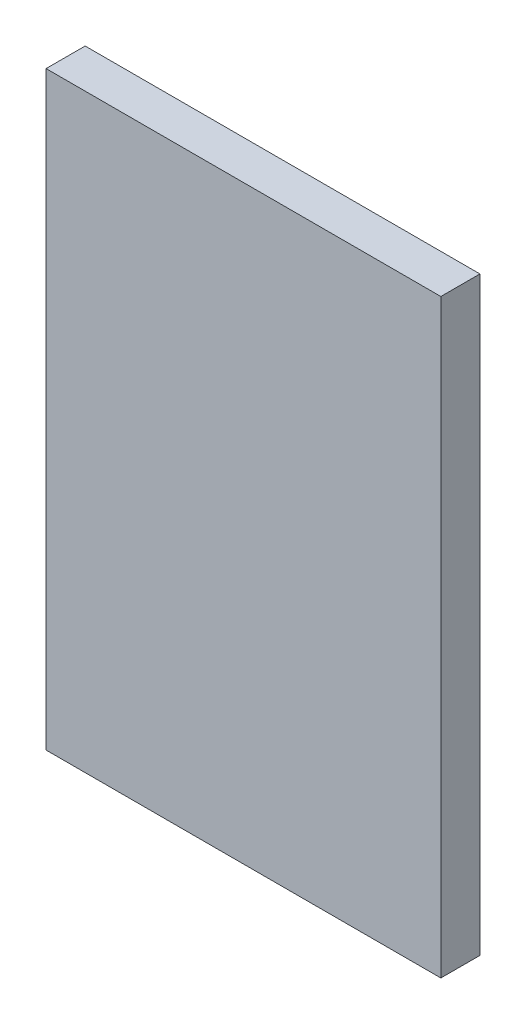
ISO-10303-21;
HEADER;
FILE_DESCRIPTION(('STEP AP214'),'2;1');
FILE_NAME('part.step','',(''),(''),'','','');
FILE_SCHEMA(('AUTOMOTIVE_DESIGN { 1 0 10303 214 1 1 1 1 }'));
ENDSEC;
DATA;
#1=APPLICATION_CONTEXT('core data for automotive mechanical design processes');
#2=APPLICATION_PROTOCOL_DEFINITION('international standard','automotive_design',2000,#1);
#3=PRODUCT_CONTEXT('',#1,'mechanical');
#4=PRODUCT('Part','Part','',(#3));
#5=PRODUCT_RELATED_PRODUCT_CATEGORY('part','',(#4));
#6=PRODUCT_DEFINITION_FORMATION('','',#4);
#7=PRODUCT_DEFINITION_CONTEXT('part definition',#1,'design');
#8=PRODUCT_DEFINITION('design','',#6,#7);
#9=PRODUCT_DEFINITION_SHAPE('','',#8);
#10=(LENGTH_UNIT() NAMED_UNIT(*) SI_UNIT(.MILLI.,.METRE.));
#11=(NAMED_UNIT(*) PLANE_ANGLE_UNIT() SI_UNIT($,.RADIAN.));
#12=(NAMED_UNIT(*) SI_UNIT($,.STERADIAN.) SOLID_ANGLE_UNIT());
#13=UNCERTAINTY_MEASURE_WITH_UNIT(LENGTH_MEASURE(1.E-05),#10,'distance_accuracy_value','');
#14=(GEOMETRIC_REPRESENTATION_CONTEXT(3) GLOBAL_UNCERTAINTY_ASSIGNED_CONTEXT((#13)) GLOBAL_UNIT_ASSIGNED_CONTEXT((#10,
#11,#12)) REPRESENTATION_CONTEXT('',''));
#15=CARTESIAN_POINT('',(0.,0.,0.));
#16=DIRECTION('',(0.,0.,1.));
#17=DIRECTION('',(1.,0.,0.));
#18=AXIS2_PLACEMENT_3D('',#15,#16,#17);
#19=CARTESIAN_POINT('',(0.,0.,1.));
#20=DIRECTION('',(0.,0.,1.));
#21=DIRECTION('',(1.,0.,0.));
#22=AXIS2_PLACEMENT_3D('',#19,#20,#21);
#23=PLANE('',#22);
#24=DIRECTION('',(1.,0.,0.));
#25=VECTOR('',#24,1.);
#26=CARTESIAN_POINT('',(5.05,7.55,1.));
#27=LINE('',#26,#25);
#28=CARTESIAN_POINT('',(-5.05,7.55,1.));
#29=VERTEX_POINT('',#28);
#30=CARTESIAN_POINT('',(5.05,7.55,1.));
#31=VERTEX_POINT('',#30);
#32=EDGE_CURVE('E67',#29,#31,#27,.T.);
#33=ORIENTED_EDGE('',*,*,#32,.F.);
#34=DIRECTION('',(0.,1.,0.));
#35=VECTOR('',#34,1.);
#36=CARTESIAN_POINT('',(-5.05,7.55,1.));
#37=LINE('',#36,#35);
#38=CARTESIAN_POINT('',(-5.05,-7.55,1.));
#39=VERTEX_POINT('',#38);
#40=EDGE_CURVE('E19',#39,#29,#37,.T.);
#41=ORIENTED_EDGE('',*,*,#40,.F.);
#42=DIRECTION('',(1.,0.,0.));
#43=VECTOR('',#42,1.);
#44=CARTESIAN_POINT('',(-5.05,-7.55,1.));
#45=LINE('',#44,#43);
#46=CARTESIAN_POINT('',(5.05,-7.55,1.));
#47=VERTEX_POINT('',#46);
#48=EDGE_CURVE('E57',#47,#39,#45,.F.);
#49=ORIENTED_EDGE('',*,*,#48,.F.);
#50=DIRECTION('',(0.,1.,0.));
#51=VECTOR('',#50,1.);
#52=CARTESIAN_POINT('',(5.05,-7.55,1.));
#53=LINE('',#52,#51);
#54=EDGE_CURVE('E52',#31,#47,#53,.F.);
#55=ORIENTED_EDGE('',*,*,#54,.F.);
#56=EDGE_LOOP('',(#33,#41,#49,#55));
#57=FACE_BOUND('',#56,.T.);
#58=ADVANCED_FACE('F16',(#57),#23,.T.);
#59=CARTESIAN_POINT('',(-5.05,7.55,0.));
#60=DIRECTION('',(-1.,0.,0.));
#61=DIRECTION('',(0.,0.,1.));
#62=AXIS2_PLACEMENT_3D('',#59,#60,#61);
#63=PLANE('',#62);
#64=DIRECTION('',(0.,0.,1.));
#65=VECTOR('',#64,1.);
#66=CARTESIAN_POINT('',(-5.05,7.55,0.));
#67=LINE('',#66,#65);
#68=CARTESIAN_POINT('',(-5.05,7.55,0.));
#69=VERTEX_POINT('',#68);
#70=EDGE_CURVE('E78',#69,#29,#67,.T.);
#71=ORIENTED_EDGE('',*,*,#70,.F.);
#72=DIRECTION('',(0.,1.,0.));
#73=VECTOR('',#72,1.);
#74=CARTESIAN_POINT('',(-5.05,0.,0.));
#75=LINE('',#74,#73);
#76=CARTESIAN_POINT('',(-5.05,-7.55,0.));
#77=VERTEX_POINT('',#76);
#78=EDGE_CURVE('E73',#69,#77,#75,.F.);
#79=ORIENTED_EDGE('',*,*,#78,.T.);
#80=DIRECTION('',(0.,0.,-1.));
#81=VECTOR('',#80,1.);
#82=CARTESIAN_POINT('',(-5.05,-7.55,0.));
#83=LINE('',#82,#81);
#84=EDGE_CURVE('E62',#39,#77,#83,.T.);
#85=ORIENTED_EDGE('',*,*,#84,.F.);
#86=ORIENTED_EDGE('',*,*,#40,.T.);
#87=EDGE_LOOP('',(#71,#79,#85,#86));
#88=FACE_BOUND('',#87,.T.);
#89=ADVANCED_FACE('F72',(#88),#63,.T.);
#90=CARTESIAN_POINT('',(-5.05,-7.55,0.));
#91=DIRECTION('',(0.,-1.,0.));
#92=DIRECTION('',(0.,0.,-1.));
#93=AXIS2_PLACEMENT_3D('',#90,#91,#92);
#94=PLANE('',#93);
#95=ORIENTED_EDGE('',*,*,#84,.T.);
#96=DIRECTION('',(1.,0.,0.));
#97=VECTOR('',#96,1.);
#98=CARTESIAN_POINT('',(0.,-7.55,0.));
#99=LINE('',#98,#97);
#100=CARTESIAN_POINT('',(5.05,-7.55,0.));
#101=VERTEX_POINT('',#100);
#102=EDGE_CURVE('E83',#77,#101,#99,.T.);
#103=ORIENTED_EDGE('',*,*,#102,.T.);
#104=DIRECTION('',(0.,0.,-1.));
#105=VECTOR('',#104,1.);
#106=CARTESIAN_POINT('',(5.05,-7.55,0.));
#107=LINE('',#106,#105);
#108=EDGE_CURVE('E64',#47,#101,#107,.T.);
#109=ORIENTED_EDGE('',*,*,#108,.F.);
#110=ORIENTED_EDGE('',*,*,#48,.T.);
#111=EDGE_LOOP('',(#95,#103,#109,#110));
#112=FACE_BOUND('',#111,.T.);
#113=ADVANCED_FACE('F59',(#112),#94,.T.);
#114=CARTESIAN_POINT('',(5.05,-7.55,0.));
#115=DIRECTION('',(1.,0.,0.));
#116=DIRECTION('',(0.,0.,-1.));
#117=AXIS2_PLACEMENT_3D('',#114,#115,#116);
#118=PLANE('',#117);
#119=ORIENTED_EDGE('',*,*,#108,.T.);
#120=DIRECTION('',(0.,1.,0.));
#121=VECTOR('',#120,1.);
#122=CARTESIAN_POINT('',(5.05,0.,0.));
#123=LINE('',#122,#121);
#124=CARTESIAN_POINT('',(5.05,7.55,0.));
#125=VERTEX_POINT('',#124);
#126=EDGE_CURVE('E25',#101,#125,#123,.T.);
#127=ORIENTED_EDGE('',*,*,#126,.T.);
#128=DIRECTION('',(0.,0.,1.));
#129=VECTOR('',#128,1.);
#130=CARTESIAN_POINT('',(5.05,7.55,0.));
#131=LINE('',#130,#129);
#132=EDGE_CURVE('E33',#31,#125,#131,.F.);
#133=ORIENTED_EDGE('',*,*,#132,.F.);
#134=ORIENTED_EDGE('',*,*,#54,.T.);
#135=EDGE_LOOP('',(#119,#127,#133,#134));
#136=FACE_BOUND('',#135,.T.);
#137=ADVANCED_FACE('F87',(#136),#118,.T.);
#138=CARTESIAN_POINT('',(5.05,7.55,0.));
#139=DIRECTION('',(0.,1.,0.));
#140=DIRECTION('',(0.,0.,1.));
#141=AXIS2_PLACEMENT_3D('',#138,#139,#140);
#142=PLANE('',#141);
#143=ORIENTED_EDGE('',*,*,#132,.T.);
#144=DIRECTION('',(1.,0.,0.));
#145=VECTOR('',#144,1.);
#146=CARTESIAN_POINT('',(0.,7.55,0.));
#147=LINE('',#146,#145);
#148=EDGE_CURVE('E11',#125,#69,#147,.F.);
#149=ORIENTED_EDGE('',*,*,#148,.T.);
#150=ORIENTED_EDGE('',*,*,#70,.T.);
#151=ORIENTED_EDGE('',*,*,#32,.T.);
#152=EDGE_LOOP('',(#143,#149,#150,#151));
#153=FACE_BOUND('',#152,.T.);
#154=ADVANCED_FACE('F90',(#153),#142,.T.);
#155=CARTESIAN_POINT('',(0.,0.,0.));
#156=DIRECTION('',(0.,0.,1.));
#157=DIRECTION('',(1.,0.,0.));
#158=AXIS2_PLACEMENT_3D('',#155,#156,#157);
#159=PLANE('',#158);
#160=ORIENTED_EDGE('',*,*,#126,.F.);
#161=ORIENTED_EDGE('',*,*,#102,.F.);
#162=ORIENTED_EDGE('',*,*,#78,.F.);
#163=ORIENTED_EDGE('',*,*,#148,.F.);
#164=EDGE_LOOP('',(#160,#161,#162,#163));
#165=FACE_BOUND('',#164,.T.);
#166=ADVANCED_FACE('F89',(#165),#159,.F.);
#167=CLOSED_SHELL('',(#58,#89,#113,#137,#154,#166));
#168=MANIFOLD_SOLID_BREP('B1',#167);
#169=ADVANCED_BREP_SHAPE_REPRESENTATION('',(#18,#168),#14);
#170=SHAPE_DEFINITION_REPRESENTATION(#9,#169);
ENDSEC;
END-ISO-10303-21;
